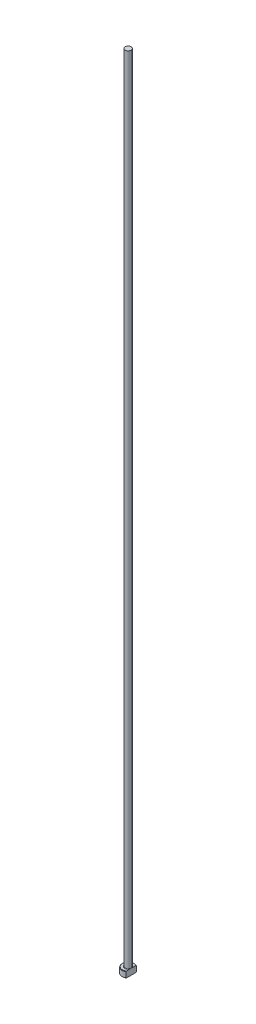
ISO-10303-21;
HEADER;
FILE_DESCRIPTION(('STEP AP214'),'2;1');
FILE_NAME('part.step','',(''),(''),'','','');
FILE_SCHEMA(('AUTOMOTIVE_DESIGN { 1 0 10303 214 1 1 1 1 }'));
ENDSEC;
DATA;
#1=APPLICATION_CONTEXT('core data for automotive mechanical design processes');
#2=APPLICATION_PROTOCOL_DEFINITION('international standard','automotive_design',2000,#1);
#3=PRODUCT_CONTEXT('',#1,'mechanical');
#4=PRODUCT('Part','Part','',(#3));
#5=PRODUCT_RELATED_PRODUCT_CATEGORY('part','',(#4));
#6=PRODUCT_DEFINITION_FORMATION('','',#4);
#7=PRODUCT_DEFINITION_CONTEXT('part definition',#1,'design');
#8=PRODUCT_DEFINITION('design','',#6,#7);
#9=PRODUCT_DEFINITION_SHAPE('','',#8);
#10=(LENGTH_UNIT() NAMED_UNIT(*) SI_UNIT(.MILLI.,.METRE.));
#11=(NAMED_UNIT(*) PLANE_ANGLE_UNIT() SI_UNIT($,.RADIAN.));
#12=(NAMED_UNIT(*) SI_UNIT($,.STERADIAN.) SOLID_ANGLE_UNIT());
#13=UNCERTAINTY_MEASURE_WITH_UNIT(LENGTH_MEASURE(1.E-05),#10,'distance_accuracy_value','');
#14=(GEOMETRIC_REPRESENTATION_CONTEXT(3) GLOBAL_UNCERTAINTY_ASSIGNED_CONTEXT((#13)) GLOBAL_UNIT_ASSIGNED_CONTEXT((#10,
#11,#12)) REPRESENTATION_CONTEXT('',''));
#15=CARTESIAN_POINT('',(0.,0.,0.));
#16=DIRECTION('',(0.,0.,1.));
#17=DIRECTION('',(1.,0.,0.));
#18=AXIS2_PLACEMENT_3D('',#15,#16,#17);
#19=CARTESIAN_POINT('',(0.,0.,0.));
#20=DIRECTION('',(0.,-1.,0.));
#21=DIRECTION('',(0.,0.,-1.));
#22=AXIS2_PLACEMENT_3D('',#19,#20,#21);
#23=PLANE('',#22);
#24=CARTESIAN_POINT('',(0.,0.,0.));
#25=DIRECTION('',(0.,-1.,0.));
#26=DIRECTION('',(0.,0.,-1.));
#27=AXIS2_PLACEMENT_3D('',#24,#25,#26);
#28=CIRCLE('',#27,2.79999999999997);
#29=CARTESIAN_POINT('',(1.49999999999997,0.,2.36431808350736));
#30=VERTEX_POINT('',#29);
#31=CARTESIAN_POINT('',(1.49999999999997,0.,-2.36431808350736));
#32=VERTEX_POINT('',#31);
#33=EDGE_CURVE('E98',#30,#32,#28,.T.);
#34=ORIENTED_EDGE('',*,*,#33,.T.);
#35=DIRECTION('',(0.,0.,1.));
#36=VECTOR('',#35,1.);
#37=CARTESIAN_POINT('',(1.49999999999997,0.,-2.5980762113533));
#38=LINE('',#37,#36);
#39=EDGE_CURVE('E83',#32,#30,#38,.T.);
#40=ORIENTED_EDGE('',*,*,#39,.T.);
#41=EDGE_LOOP('',(#34,#40));
#42=FACE_BOUND('',#41,.T.);
#43=ADVANCED_FACE('F32',(#42),#23,.T.);
#44=CARTESIAN_POINT('',(0.,259.958771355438,0.));
#45=DIRECTION('',(0.,1.,0.));
#46=DIRECTION('',(0.,0.,1.));
#47=AXIS2_PLACEMENT_3D('',#44,#45,#46);
#48=CYLINDRICAL_SURFACE('',#47,2.99999999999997);
#49=CARTESIAN_POINT('',(0.,2.80000000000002,0.));
#50=DIRECTION('',(0.,1.,0.));
#51=DIRECTION('',(0.,0.,1.));
#52=AXIS2_PLACEMENT_3D('',#49,#50,#51);
#53=CIRCLE('',#52,2.99999999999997);
#54=CARTESIAN_POINT('',(1.49999999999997,2.80000000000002,2.5980762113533));
#55=VERTEX_POINT('',#54);
#56=CARTESIAN_POINT('',(1.49999999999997,2.80000000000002,-2.5980762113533));
#57=VERTEX_POINT('',#56);
#58=EDGE_CURVE('E104',#55,#57,#53,.F.);
#59=ORIENTED_EDGE('',*,*,#58,.T.);
#60=DIRECTION('',(0.,-1.,0.));
#61=VECTOR('',#60,1.);
#62=CARTESIAN_POINT('',(1.49999999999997,400.,-2.5980762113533));
#63=LINE('',#62,#61);
#64=CARTESIAN_POINT('',(1.49999999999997,0.199999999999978,-2.5980762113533));
#65=VERTEX_POINT('',#64);
#66=EDGE_CURVE('E183',#57,#65,#63,.T.);
#67=ORIENTED_EDGE('',*,*,#66,.T.);
#68=CARTESIAN_POINT('',(0.,0.199999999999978,0.));
#69=DIRECTION('',(0.,-1.,0.));
#70=DIRECTION('',(0.,0.,-1.));
#71=AXIS2_PLACEMENT_3D('',#68,#69,#70);
#72=CIRCLE('',#71,2.99999999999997);
#73=CARTESIAN_POINT('',(1.49999999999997,0.199999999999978,2.5980762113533));
#74=VERTEX_POINT('',#73);
#75=EDGE_CURVE('E100',#65,#74,#72,.F.);
#76=ORIENTED_EDGE('',*,*,#75,.T.);
#77=DIRECTION('',(0.,-1.,0.));
#78=VECTOR('',#77,1.);
#79=CARTESIAN_POINT('',(1.49999999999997,400.,2.5980762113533));
#80=LINE('',#79,#78);
#81=EDGE_CURVE('E93',#55,#74,#80,.T.);
#82=ORIENTED_EDGE('',*,*,#81,.F.);
#83=EDGE_LOOP('',(#59,#67,#76,#82));
#84=FACE_BOUND('',#83,.T.);
#85=ADVANCED_FACE('F158',(#84),#48,.T.);
#86=CARTESIAN_POINT('',(-2.99999999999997,3.,0.));
#87=DIRECTION('',(0.,1.,0.));
#88=DIRECTION('',(0.,0.,1.));
#89=AXIS2_PLACEMENT_3D('',#86,#87,#88);
#90=PLANE('',#89);
#91=CARTESIAN_POINT('',(0.,3.,0.));
#92=DIRECTION('',(0.,1.,0.));
#93=DIRECTION('',(0.,0.,1.));
#94=AXIS2_PLACEMENT_3D('',#91,#92,#93);
#95=CIRCLE('',#94,2.80000000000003);
#96=CARTESIAN_POINT('',(1.49999999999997,3.,-2.36431808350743));
#97=VERTEX_POINT('',#96);
#98=CARTESIAN_POINT('',(1.49999999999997,3.,2.36431808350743));
#99=VERTEX_POINT('',#98);
#100=EDGE_CURVE('E178',#97,#99,#95,.T.);
#101=ORIENTED_EDGE('',*,*,#100,.T.);
#102=DIRECTION('',(0.,0.,-1.));
#103=VECTOR('',#102,1.);
#104=CARTESIAN_POINT('',(1.49999999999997,3.,0.));
#105=LINE('',#104,#103);
#106=CARTESIAN_POINT('',(1.49999999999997,2.99999999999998,0.799999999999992));
#107=VERTEX_POINT('',#106);
#108=EDGE_CURVE('E57',#99,#107,#105,.T.);
#109=ORIENTED_EDGE('',*,*,#108,.T.);
#110=CARTESIAN_POINT('',(0.,3.,0.));
#111=DIRECTION('',(0.,1.,0.));
#112=DIRECTION('',(0.,0.,1.));
#113=AXIS2_PLACEMENT_3D('',#110,#111,#112);
#114=CIRCLE('',#113,1.69999999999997);
#115=CARTESIAN_POINT('',(1.49999999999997,2.99999999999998,-0.799999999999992));
#116=VERTEX_POINT('',#115);
#117=EDGE_CURVE('E107',#107,#116,#114,.F.);
#118=ORIENTED_EDGE('',*,*,#117,.T.);
#119=EDGE_CURVE('E136',#116,#97,#105,.T.);
#120=ORIENTED_EDGE('',*,*,#119,.T.);
#121=EDGE_LOOP('',(#101,#109,#118,#120));
#122=FACE_BOUND('',#121,.T.);
#123=ADVANCED_FACE('F147',(#122),#90,.T.);
#124=CARTESIAN_POINT('',(0.,3.,0.));
#125=DIRECTION('',(0.,-1.,0.));
#126=DIRECTION('',(0.,0.,-1.));
#127=AXIS2_PLACEMENT_3D('',#124,#125,#126);
#128=CONICAL_SURFACE('',#127,2.80000000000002,0.785398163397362);
#129=ORIENTED_EDGE('',*,*,#58,.F.);
#130=CARTESIAN_POINT('',(1.49999999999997,-0.111741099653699,5.71827621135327));
#131=CARTESIAN_POINT('',(1.49999999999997,0.013618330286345,5.58866816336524));
#132=CARTESIAN_POINT('',(1.49999999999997,0.138843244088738,5.45892957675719));
#133=CARTESIAN_POINT('',(1.49999999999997,0.388944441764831,5.19911365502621));
#134=CARTESIAN_POINT('',(1.49999999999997,0.513820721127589,5.06903631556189));
#135=CARTESIAN_POINT('',(1.49999999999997,0.763205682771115,4.80840180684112));
#136=CARTESIAN_POINT('',(1.49999999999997,0.887714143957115,4.67784442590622));
#137=CARTESIAN_POINT('',(1.49999999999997,1.13618059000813,4.41620813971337));
#138=CARTESIAN_POINT('',(1.49999999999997,1.26013857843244,4.28512923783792));
#139=CARTESIAN_POINT('',(1.49999999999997,1.50488975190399,4.02490837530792));
#140=CARTESIAN_POINT('',(1.49999999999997,1.62569693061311,3.89577958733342));
#141=CARTESIAN_POINT('',(1.49999999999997,1.86640694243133,3.63668213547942));
#142=CARTESIAN_POINT('',(1.49999999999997,1.98630978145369,3.50671347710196));
#143=CARTESIAN_POINT('',(1.49999999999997,2.2248603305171,3.24567921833));
#144=CARTESIAN_POINT('',(1.49999999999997,2.34350830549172,3.11461386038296));
#145=CARTESIAN_POINT('',(1.49999999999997,2.57907716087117,2.85094268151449));
#146=CARTESIAN_POINT('',(1.49999999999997,2.69599811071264,2.71833692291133));
#147=CARTESIAN_POINT('',(1.49999999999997,2.88262371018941,2.50255231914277));
#148=CARTESIAN_POINT('',(1.49999999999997,2.95312454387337,2.42006293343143));
#149=CARTESIAN_POINT('',(1.49999999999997,3.0928709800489,2.25401084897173));
#150=CARTESIAN_POINT('',(1.49999999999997,3.16211645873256,2.17044804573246));
#151=CARTESIAN_POINT('',(1.49999999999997,3.29964684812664,2.00105967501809));
#152=CARTESIAN_POINT('',(1.49999999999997,3.36791386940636,1.91521952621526));
#153=CARTESIAN_POINT('',(1.49999999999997,3.50205840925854,1.74171392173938));
#154=CARTESIAN_POINT('',(1.49999999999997,3.56793649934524,1.65404891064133));
#155=CARTESIAN_POINT('',(1.49999999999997,3.69728151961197,1.47490236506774));
#156=CARTESIAN_POINT('',(1.49999999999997,3.76069661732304,1.3833830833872));
#157=CARTESIAN_POINT('',(1.49999999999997,3.88239539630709,1.19675661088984));
#158=CARTESIAN_POINT('',(1.49999999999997,3.94067201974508,1.10164473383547));
#159=CARTESIAN_POINT('',(1.49999999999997,4.04841325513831,0.908008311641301));
#160=CARTESIAN_POINT('',(1.49999999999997,4.09797809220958,0.809540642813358));
#161=CARTESIAN_POINT('',(1.49999999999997,4.18432188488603,0.607192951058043));
#162=CARTESIAN_POINT('',(1.49999999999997,4.22114374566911,0.50333247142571));
#163=CARTESIAN_POINT('',(1.49999999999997,4.26099935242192,0.347577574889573));
#164=CARTESIAN_POINT('',(1.49999999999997,4.27157029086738,0.297609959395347));
#165=CARTESIAN_POINT('',(1.49999999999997,4.28794860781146,0.196885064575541));
#166=CARTESIAN_POINT('',(1.49999999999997,4.29375640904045,0.1461278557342));
#167=CARTESIAN_POINT('',(1.49999999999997,4.30019707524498,0.0444388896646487));
#168=CARTESIAN_POINT('',(1.49999999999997,4.30084594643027,-0.0064918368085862));
#169=CARTESIAN_POINT('',(1.49999999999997,4.29696416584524,-0.108155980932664));
#170=CARTESIAN_POINT('',(1.49999999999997,4.29243308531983,-0.158889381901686));
#171=CARTESIAN_POINT('',(1.49999999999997,4.27856915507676,-0.259234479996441));
#172=CARTESIAN_POINT('',(1.49999999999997,4.26927821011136,-0.308852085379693));
#173=CARTESIAN_POINT('',(1.49999999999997,4.24647108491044,-0.407110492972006));
#174=CARTESIAN_POINT('',(1.49999999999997,4.23295324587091,-0.455750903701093));
#175=CARTESIAN_POINT('',(1.49999999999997,4.20226175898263,-0.552149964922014));
#176=CARTESIAN_POINT('',(1.49999999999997,4.18506801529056,-0.599902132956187));
#177=CARTESIAN_POINT('',(1.49999999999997,4.14771387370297,-0.694205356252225));
#178=CARTESIAN_POINT('',(1.49999999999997,4.12755408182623,-0.74075665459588));
#179=CARTESIAN_POINT('',(1.49999999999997,4.06327696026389,-0.879166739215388));
#180=CARTESIAN_POINT('',(1.49999999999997,4.01551721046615,-0.969329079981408));
#181=CARTESIAN_POINT('',(1.49999999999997,3.91367909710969,-1.14604316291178));
#182=CARTESIAN_POINT('',(1.49999999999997,3.85959300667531,-1.23259031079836));
#183=CARTESIAN_POINT('',(1.49999999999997,3.74697968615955,-1.40321348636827));
#184=CARTESIAN_POINT('',(1.49999999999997,3.68843573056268,-1.48727838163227));
#185=CARTESIAN_POINT('',(1.49999999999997,3.56843845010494,-1.65322187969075));
#186=CARTESIAN_POINT('',(1.49999999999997,3.50698656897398,-1.73510153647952));
#187=CARTESIAN_POINT('',(1.49999999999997,3.3811567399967,-1.89829823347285));
#188=CARTESIAN_POINT('',(1.49999999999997,3.31675092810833,-1.97959369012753));
#189=CARTESIAN_POINT('',(1.49999999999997,3.18634068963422,-2.14090082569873));
#190=CARTESIAN_POINT('',(1.49999999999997,3.12033609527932,-2.22091236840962));
#191=CARTESIAN_POINT('',(1.49999999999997,2.92086431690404,-2.4590650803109));
#192=CARTESIAN_POINT('',(1.49999999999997,2.78562663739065,-2.61572090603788));
#193=CARTESIAN_POINT('',(1.49999999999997,2.53554498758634,-2.90006295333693));
#194=CARTESIAN_POINT('',(1.49999999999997,2.42114543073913,-3.0281438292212));
#195=CARTESIAN_POINT('',(1.49999999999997,2.19093557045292,-3.28303767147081));
#196=CARTESIAN_POINT('',(1.49999999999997,2.07512522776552,-3.40985060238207));
#197=CARTESIAN_POINT('',(1.49999999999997,1.72597067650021,-3.7891384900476));
#198=CARTESIAN_POINT('',(1.49999999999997,1.49111760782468,-4.04022177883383));
#199=CARTESIAN_POINT('',(1.49999999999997,1.02882478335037,-4.52992803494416));
#200=CARTESIAN_POINT('',(1.49999999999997,0.801477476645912,-4.76863870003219));
#201=CARTESIAN_POINT('',(1.49999999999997,0.459548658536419,-5.12558036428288));
#202=CARTESIAN_POINT('',(1.49999999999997,0.345484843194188,-5.24430773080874));
#203=CARTESIAN_POINT('',(1.49999999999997,0.117071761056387,-5.48148573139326));
#204=CARTESIAN_POINT('',(1.49999999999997,0.00272249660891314,-5.59993636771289));
#205=CARTESIAN_POINT('',(1.49999999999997,-0.111741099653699,-5.71827621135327));
#206=B_SPLINE_CURVE_WITH_KNOTS('',3,(#130,#131,#132,#133,#134,#135,#136,#137,#138,#139,#140,
#141,#142,#143,#144,#145,#146,#147,#148,#149,#150,#151,#152,#153,#154,#155,#156,#157,#158,#159,
#160,#161,#162,#163,#164,#165,#166,#167,#168,#169,#170,#171,#172,#173,#174,#175,#176,#177,#178,
#179,#180,#181,#182,#183,#184,#185,#186,#187,#188,#189,#190,#191,#192,#193,#194,#195,#196,#197,
#198,#199,#200,#201,#202,#203,#204,#205),.UNSPECIFIED.,.F.,.F.,(4,2,2,2,2,2,2,2,2,2,2,2,2,2,2,2,
2,2,2,2,2,2,2,2,2,2,2,2,2,2,2,2,2,2,2,2,2,4),(0.,0.540943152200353,1.08189327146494,
1.62312052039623,2.16434426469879,2.69482920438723,3.22531067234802,3.75567781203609,
4.28602356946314,4.61155053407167,4.93710943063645,5.26610945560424,5.59503024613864,
5.92894782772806,6.26331713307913,6.59354403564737,6.92264800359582,7.07567478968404,
7.22868799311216,7.38122626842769,7.53377717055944,7.68500755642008,7.83629736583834,
7.98843643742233,8.14054446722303,8.44618799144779,8.75220879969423,9.05944044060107,
9.3665211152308,9.67764287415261,9.98879742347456,10.6095925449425,11.1247803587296,
11.6399825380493,12.6713544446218,13.6603005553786,14.1542238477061,14.6481430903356),.UNSPECIFIED.);
#207=EDGE_CURVE('E135',#55,#99,#206,.T.);
#208=ORIENTED_EDGE('',*,*,#207,.T.);
#209=ORIENTED_EDGE('',*,*,#100,.F.);
#210=EDGE_CURVE('E127',#97,#57,#206,.T.);
#211=ORIENTED_EDGE('',*,*,#210,.T.);
#212=EDGE_LOOP('',(#129,#208,#209,#211));
#213=FACE_BOUND('',#212,.T.);
#214=ADVANCED_FACE('F143',(#213),#128,.T.);
#215=CARTESIAN_POINT('',(0.,0.199999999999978,0.));
#216=DIRECTION('',(0.,1.,0.));
#217=DIRECTION('',(0.,0.,1.));
#218=AXIS2_PLACEMENT_3D('',#215,#216,#217);
#219=CONICAL_SURFACE('',#218,2.99999999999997,0.7853981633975);
#220=ORIENTED_EDGE('',*,*,#75,.F.);
#221=CARTESIAN_POINT('',(1.49999999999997,3.11174109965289,-5.71827621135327));
#222=CARTESIAN_POINT('',(1.49999999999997,2.98638166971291,-5.58866816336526));
#223=CARTESIAN_POINT('',(1.49999999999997,2.86115675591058,-5.45892957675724));
#224=CARTESIAN_POINT('',(1.49999999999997,2.6110555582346,-5.19911365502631));
#225=CARTESIAN_POINT('',(1.49999999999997,2.4861792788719,-5.06903631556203));
#226=CARTESIAN_POINT('',(1.49999999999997,2.2367943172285,-4.8084018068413));
#227=CARTESIAN_POINT('',(1.49999999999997,2.11228585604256,-4.67784442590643));
#228=CARTESIAN_POINT('',(1.49999999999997,1.86381940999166,-4.41620813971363));
#229=CARTESIAN_POINT('',(1.49999999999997,1.73986142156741,-4.28512923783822));
#230=CARTESIAN_POINT('',(1.49999999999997,1.49511024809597,-4.02490837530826));
#231=CARTESIAN_POINT('',(1.49999999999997,1.37430306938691,-3.89577958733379));
#232=CARTESIAN_POINT('',(1.49999999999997,1.1335930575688,-3.63668213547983));
#233=CARTESIAN_POINT('',(1.49999999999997,1.01369021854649,-3.5067134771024));
#234=CARTESIAN_POINT('',(1.49999999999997,0.775139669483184,-3.24567921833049));
#235=CARTESIAN_POINT('',(1.49999999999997,0.656491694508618,-3.11461386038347));
#236=CARTESIAN_POINT('',(1.49999999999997,0.420922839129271,-2.85094268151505));
#237=CARTESIAN_POINT('',(1.49999999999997,0.304001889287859,-2.71833692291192));
#238=CARTESIAN_POINT('',(1.49999999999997,0.117376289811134,-2.50255231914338));
#239=CARTESIAN_POINT('',(1.49999999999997,0.0468754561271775,-2.42006293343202));
#240=CARTESIAN_POINT('',(1.49999999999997,-0.0928709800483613,-2.25401084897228));
#241=CARTESIAN_POINT('',(1.49999999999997,-0.16211645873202,-2.170448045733));
#242=CARTESIAN_POINT('',(1.49999999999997,-0.299646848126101,-2.00105967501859));
#243=CARTESIAN_POINT('',(1.49999999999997,-0.36791386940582,-1.91521952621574));
#244=CARTESIAN_POINT('',(1.49999999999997,-0.502058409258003,-1.74171392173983));
#245=CARTESIAN_POINT('',(1.49999999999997,-0.567936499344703,-1.65404891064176));
#246=CARTESIAN_POINT('',(1.49999999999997,-0.697281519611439,-1.47490236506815));
#247=CARTESIAN_POINT('',(1.49999999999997,-0.760696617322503,-1.38338308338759));
#248=CARTESIAN_POINT('',(1.49999999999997,-0.88239539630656,-1.1967566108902));
#249=CARTESIAN_POINT('',(1.49999999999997,-0.940672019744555,-1.10164473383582));
#250=CARTESIAN_POINT('',(1.49999999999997,-1.04841325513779,-0.908008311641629));
#251=CARTESIAN_POINT('',(1.49999999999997,-1.09797809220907,-0.809540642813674));
#252=CARTESIAN_POINT('',(1.49999999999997,-1.18432188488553,-0.607192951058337));
#253=CARTESIAN_POINT('',(1.49999999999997,-1.22114374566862,-0.503332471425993));
#254=CARTESIAN_POINT('',(1.49999999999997,-1.26099935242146,-0.347577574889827));
#255=CARTESIAN_POINT('',(1.49999999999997,-1.27157029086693,-0.297609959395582));
#256=CARTESIAN_POINT('',(1.49999999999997,-1.28794860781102,-0.19688506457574));
#257=CARTESIAN_POINT('',(1.49999999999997,-1.29375640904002,-0.146127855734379));
#258=CARTESIAN_POINT('',(1.49999999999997,-1.30019707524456,-0.0444388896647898));
#259=CARTESIAN_POINT('',(1.49999999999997,-1.30084594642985,0.00649183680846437));
#260=CARTESIAN_POINT('',(1.49999999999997,-1.29696416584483,0.108155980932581));
#261=CARTESIAN_POINT('',(1.49999999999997,-1.29243308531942,0.158889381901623));
#262=CARTESIAN_POINT('',(1.49999999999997,-1.27856915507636,0.259234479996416));
#263=CARTESIAN_POINT('',(1.49999999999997,-1.26927821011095,0.308852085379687));
#264=CARTESIAN_POINT('',(1.49999999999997,-1.24647108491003,0.407110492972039));
#265=CARTESIAN_POINT('',(1.49999999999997,-1.2329532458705,0.455750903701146));
#266=CARTESIAN_POINT('',(1.49999999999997,-1.20226175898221,0.552149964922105));
#267=CARTESIAN_POINT('',(1.49999999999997,-1.18506801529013,0.599902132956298));
#268=CARTESIAN_POINT('',(1.49999999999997,-1.14771387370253,0.694205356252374));
#269=CARTESIAN_POINT('',(1.49999999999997,-1.12755408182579,0.740756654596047));
#270=CARTESIAN_POINT('',(1.49999999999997,-1.06327696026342,0.879166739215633));
#271=CARTESIAN_POINT('',(1.49999999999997,-1.01551721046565,0.969329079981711));
#272=CARTESIAN_POINT('',(1.49999999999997,-0.913679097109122,1.1460431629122));
#273=CARTESIAN_POINT('',(1.49999999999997,-0.859593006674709,1.23259031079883));
#274=CARTESIAN_POINT('',(1.49999999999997,-0.746979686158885,1.40321348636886));
#275=CARTESIAN_POINT('',(1.49999999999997,-0.688435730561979,1.48727838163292));
#276=CARTESIAN_POINT('',(1.49999999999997,-0.568438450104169,1.6532218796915));
#277=CARTESIAN_POINT('',(1.49999999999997,-0.506986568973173,1.73510153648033));
#278=CARTESIAN_POINT('',(1.49999999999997,-0.381156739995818,1.89829823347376));
#279=CARTESIAN_POINT('',(1.49999999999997,-0.316750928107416,1.9795936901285));
#280=CARTESIAN_POINT('',(1.49999999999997,-0.186340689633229,2.14090082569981));
#281=CARTESIAN_POINT('',(1.49999999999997,-0.120336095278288,2.22091236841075));
#282=CARTESIAN_POINT('',(1.49999999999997,0.0791356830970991,2.45906508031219));
#283=CARTESIAN_POINT('',(1.49999999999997,0.21437336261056,2.61572090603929));
#284=CARTESIAN_POINT('',(1.49999999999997,0.464455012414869,2.90006295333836));
#285=CARTESIAN_POINT('',(1.49999999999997,0.578854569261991,3.02814382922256));
#286=CARTESIAN_POINT('',(1.49999999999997,0.809064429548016,3.28303767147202));
#287=CARTESIAN_POINT('',(1.49999999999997,0.924874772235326,3.40985060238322));
#288=CARTESIAN_POINT('',(1.49999999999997,1.27402932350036,3.78913849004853));
#289=CARTESIAN_POINT('',(1.49999999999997,1.50888239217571,4.04022177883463));
#290=CARTESIAN_POINT('',(1.49999999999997,1.97117521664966,4.52992803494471));
#291=CARTESIAN_POINT('',(1.49999999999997,2.19852252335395,4.76863870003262));
#292=CARTESIAN_POINT('',(1.49999999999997,2.54045134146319,5.12558036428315));
#293=CARTESIAN_POINT('',(1.49999999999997,2.65451515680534,5.24430773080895));
#294=CARTESIAN_POINT('',(1.49999999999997,2.88292823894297,5.48148573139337));
#295=CARTESIAN_POINT('',(1.49999999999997,2.99727750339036,5.59993636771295));
#296=CARTESIAN_POINT('',(1.49999999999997,3.11174109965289,5.71827621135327));
#297=B_SPLINE_CURVE_WITH_KNOTS('',3,(#221,#222,#223,#224,#225,#226,#227,#228,#229,#230,#231,
#232,#233,#234,#235,#236,#237,#238,#239,#240,#241,#242,#243,#244,#245,#246,#247,#248,#249,#250,
#251,#252,#253,#254,#255,#256,#257,#258,#259,#260,#261,#262,#263,#264,#265,#266,#267,#268,#269,
#270,#271,#272,#273,#274,#275,#276,#277,#278,#279,#280,#281,#282,#283,#284,#285,#286,#287,#288,
#289,#290,#291,#292,#293,#294,#295,#296),.UNSPECIFIED.,.F.,.F.,(4,2,2,2,2,2,2,2,2,2,2,2,2,2,2,2,
2,2,2,2,2,2,2,2,2,2,2,2,2,2,2,2,2,2,2,2,2,4),(0.,0.540943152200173,1.08189327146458,
1.62312052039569,2.16434426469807,2.69482920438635,3.22531067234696,3.75567781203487,
4.28602356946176,4.61155053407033,4.93710943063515,5.26610945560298,5.59503024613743,
5.92894782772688,6.26331713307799,6.59354403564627,6.92264800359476,7.07567478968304,
7.22868799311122,7.38122626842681,7.53377717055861,7.68500755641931,7.83629736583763,
7.98843643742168,8.14054446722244,8.44618799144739,8.75220879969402,9.05944044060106,
9.36652111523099,9.67764287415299,9.98879742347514,10.6095925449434,11.1247803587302,
11.6399825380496,12.6713544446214,13.6603005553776,14.1542238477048,14.648143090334),.UNSPECIFIED.);
#298=EDGE_CURVE('E86',#65,#32,#297,.T.);
#299=ORIENTED_EDGE('',*,*,#298,.T.);
#300=ORIENTED_EDGE('',*,*,#33,.F.);
#301=EDGE_CURVE('E89',#30,#74,#297,.T.);
#302=ORIENTED_EDGE('',*,*,#301,.T.);
#303=EDGE_LOOP('',(#220,#299,#300,#302));
#304=FACE_BOUND('',#303,.T.);
#305=ADVANCED_FACE('F97',(#304),#219,.T.);
#306=CARTESIAN_POINT('',(0.,3.19999999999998,0.));
#307=DIRECTION('',(0.,1.,0.));
#308=DIRECTION('',(0.,0.,1.));
#309=AXIS2_PLACEMENT_3D('',#306,#307,#308);
#310=TOROIDAL_SURFACE('',#309,1.69999999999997,0.2);
#311=CARTESIAN_POINT('',(1.49999999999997,3.19999999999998,0.));
#312=CARTESIAN_POINT('',(1.49999999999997,3.20000050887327,7.14686524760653E-11));
#313=CARTESIAN_POINT('',(1.49999999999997,3.20000101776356,-1.21663671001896E-07));
#314=CARTESIAN_POINT('',(1.49999999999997,3.20000199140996,-4.97616231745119E-07));
#315=CARTESIAN_POINT('',(1.49999999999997,3.20000245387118,-7.56516213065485E-07));
#316=CARTESIAN_POINT('',(1.49999999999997,3.20000338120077,-1.37642836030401E-06));
#317=CARTESIAN_POINT('',(1.49999999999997,3.20000384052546,-1.74563475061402E-06));
#318=CARTESIAN_POINT('',(1.49999999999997,3.20000469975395,-2.53565983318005E-06));
#319=CARTESIAN_POINT('',(1.49999999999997,3.20000510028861,-2.95582595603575E-06));
#320=CARTESIAN_POINT('',(1.49999999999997,3.20000646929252,-4.48430443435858E-06));
#321=CARTESIAN_POINT('',(1.49999999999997,3.20000736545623,-5.6586103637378E-06));
#322=CARTESIAN_POINT('',(1.49999999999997,3.20000893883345,-8.06479198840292E-06));
#323=CARTESIAN_POINT('',(1.49999999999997,3.20000962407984,-9.29170513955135E-06));
#324=CARTESIAN_POINT('',(1.49999999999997,3.2000122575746,-1.41623288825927E-05));
#325=CARTESIAN_POINT('',(1.49999999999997,3.20001407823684,-1.78790031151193E-05));
#326=CARTESIAN_POINT('',(1.49999999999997,3.20001699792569,-2.51443065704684E-05));
#327=CARTESIAN_POINT('',(1.49999999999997,3.20001815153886,-2.86715393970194E-05));
#328=CARTESIAN_POINT('',(1.49999999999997,3.20002315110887,-4.39218127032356E-05));
#329=CARTESIAN_POINT('',(1.49999999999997,3.2000270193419,-5.56288388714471E-05));
#330=CARTESIAN_POINT('',(1.49999999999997,3.20003312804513,-7.74058287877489E-05));
#331=CARTESIAN_POINT('',(1.49999999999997,3.20003553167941,-8.7427840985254E-05));
#332=CARTESIAN_POINT('',(1.49999999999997,3.20005483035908,-0.00016122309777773));
#333=CARTESIAN_POINT('',(1.49999999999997,3.2000797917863,-0.000222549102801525));
#334=CARTESIAN_POINT('',(1.49999999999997,3.20017391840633,-0.000462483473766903));
#335=CARTESIAN_POINT('',(1.49999999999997,3.20023706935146,-0.000642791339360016));
#336=CARTESIAN_POINT('',(1.49999999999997,3.20048761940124,-0.00134785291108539));
#337=CARTESIAN_POINT('',(1.49999999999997,3.20068132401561,-0.00187087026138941));
#338=CARTESIAN_POINT('',(1.49999999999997,3.20147357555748,-0.0040200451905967));
#339=CARTESIAN_POINT('',(1.49999999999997,3.20206499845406,-0.00564811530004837));
#340=CARTESIAN_POINT('',(1.49999999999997,3.2089263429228,-0.0245232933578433));
#341=CARTESIAN_POINT('',(1.49999999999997,3.21523683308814,-0.0417598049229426));
#342=CARTESIAN_POINT('',(1.49999999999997,3.22755028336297,-0.0756091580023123));
#343=CARTESIAN_POINT('',(1.49999999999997,3.23355589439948,-0.0922211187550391));
#344=CARTESIAN_POINT('',(1.49999999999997,3.2462010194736,-0.127454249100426));
#345=CARTESIAN_POINT('',(1.49999999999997,3.25283080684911,-0.146078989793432));
#346=CARTESIAN_POINT('',(1.49999999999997,3.26599765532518,-0.183577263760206));
#347=CARTESIAN_POINT('',(1.49999999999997,3.2725330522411,-0.202451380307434));
#348=CARTESIAN_POINT('',(1.49999999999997,3.28834228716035,-0.248982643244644));
#349=CARTESIAN_POINT('',(1.49999999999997,3.29749152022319,-0.276682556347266));
#350=CARTESIAN_POINT('',(1.49999999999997,3.3149093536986,-0.331625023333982));
#351=CARTESIAN_POINT('',(1.49999999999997,3.32319386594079,-0.358862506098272));
#352=CARTESIAN_POINT('',(1.49999999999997,3.34051594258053,-0.419125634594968));
#353=CARTESIAN_POINT('',(1.49999999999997,3.34936607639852,-0.452206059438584));
#354=CARTESIAN_POINT('',(1.49999999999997,3.36549583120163,-0.519023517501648));
#355=CARTESIAN_POINT('',(1.49999999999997,3.37276283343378,-0.552763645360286));
#356=CARTESIAN_POINT('',(1.49999999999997,3.38554755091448,-0.623053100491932));
#357=CARTESIAN_POINT('',(1.49999999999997,3.39090573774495,-0.659632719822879));
#358=CARTESIAN_POINT('',(1.49999999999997,3.39825016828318,-0.733028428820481));
#359=CARTESIAN_POINT('',(1.49999999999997,3.40024734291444,-0.769843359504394));
#360=CARTESIAN_POINT('',(1.49999999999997,3.39970780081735,-0.842856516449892));
#361=CARTESIAN_POINT('',(1.49999999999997,3.39725347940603,-0.87905368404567));
#362=CARTESIAN_POINT('',(1.49999999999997,3.38900085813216,-0.932380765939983));
#363=CARTESIAN_POINT('',(1.49999999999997,3.38553049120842,-0.949868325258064));
#364=CARTESIAN_POINT('',(1.49999999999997,3.37678336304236,-0.98437493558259));
#365=CARTESIAN_POINT('',(1.49999999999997,3.37150943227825,-1.00139467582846));
#366=CARTESIAN_POINT('',(1.49999999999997,3.35869781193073,-1.03479423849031));
#367=CARTESIAN_POINT('',(1.49999999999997,3.3511359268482,-1.05116499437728));
#368=CARTESIAN_POINT('',(1.49999999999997,3.33325333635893,-1.08234828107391));
#369=CARTESIAN_POINT('',(1.49999999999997,3.32294266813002,-1.097166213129));
#370=CARTESIAN_POINT('',(1.49999999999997,3.30512758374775,-1.11714173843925));
#371=CARTESIAN_POINT('',(1.49999999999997,3.29884721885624,-1.1233906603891));
#372=CARTESIAN_POINT('',(1.49999999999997,3.28545950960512,-1.13494695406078));
#373=CARTESIAN_POINT('',(1.49999999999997,3.27835226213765,-1.14025443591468));
#374=CARTESIAN_POINT('',(1.49999999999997,3.26325970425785,-1.14967631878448));
#375=CARTESIAN_POINT('',(1.49999999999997,3.25526534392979,-1.1537764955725));
#376=CARTESIAN_POINT('',(1.49999999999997,3.23863207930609,-1.16034952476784));
#377=CARTESIAN_POINT('',(1.49999999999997,3.22999427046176,-1.16282507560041));
#378=CARTESIAN_POINT('',(1.49999999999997,3.21343922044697,-1.16570267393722));
#379=CARTESIAN_POINT('',(1.49999999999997,3.20555896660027,-1.16631687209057));
#380=CARTESIAN_POINT('',(1.49999999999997,3.18982775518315,-1.16602054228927));
#381=CARTESIAN_POINT('',(1.49999999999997,3.18197679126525,-1.16511036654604));
#382=CARTESIAN_POINT('',(1.49999999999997,3.16747846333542,-1.16204446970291));
#383=CARTESIAN_POINT('',(1.49999999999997,3.16079696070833,-1.16004509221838));
#384=CARTESIAN_POINT('',(1.49999999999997,3.14781700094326,-1.15505972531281));
#385=CARTESIAN_POINT('',(1.49999999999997,3.14151862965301,-1.1520735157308));
#386=CARTESIAN_POINT('',(1.49999999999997,3.12690214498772,-1.14387585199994));
#387=CARTESIAN_POINT('',(1.49999999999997,3.11881436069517,-1.13825400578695));
#388=CARTESIAN_POINT('',(1.49999999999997,3.1036444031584,-1.12578441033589));
#389=CARTESIAN_POINT('',(1.49999999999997,3.09656475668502,-1.11893367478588));
#390=CARTESIAN_POINT('',(1.49999999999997,3.08012297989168,-1.10074342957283));
#391=CARTESIAN_POINT('',(1.49999999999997,3.07136543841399,-1.08886044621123));
#392=CARTESIAN_POINT('',(1.49999999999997,3.05578194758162,-1.06392743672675));
#393=CARTESIAN_POINT('',(1.49999999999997,3.0489571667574,-1.05087671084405));
#394=CARTESIAN_POINT('',(1.49999999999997,3.03273856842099,-1.0147230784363));
#395=CARTESIAN_POINT('',(1.49999999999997,3.02486230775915,-0.990945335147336));
#396=CARTESIAN_POINT('',(1.49999999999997,3.01257693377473,-0.942321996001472));
#397=CARTESIAN_POINT('',(1.49999999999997,3.00820590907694,-0.917467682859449));
#398=CARTESIAN_POINT('',(1.49999999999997,3.00229956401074,-0.867912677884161));
#399=CARTESIAN_POINT('',(1.49999999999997,3.0007128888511,-0.843217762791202));
#400=CARTESIAN_POINT('',(1.49999999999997,2.9996723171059,-0.793746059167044));
#401=CARTESIAN_POINT('',(1.49999999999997,3.0002230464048,-0.768969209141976));
#402=CARTESIAN_POINT('',(1.49999999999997,3.00433101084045,-0.696994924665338));
#403=CARTESIAN_POINT('',(1.49999999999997,3.01016976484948,-0.649931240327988));
#404=CARTESIAN_POINT('',(1.49999999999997,3.02567776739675,-0.559166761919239));
#405=CARTESIAN_POINT('',(1.49999999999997,3.03511950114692,-0.515423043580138));
#406=CARTESIAN_POINT('',(1.49999999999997,3.05693059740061,-0.427590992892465));
#407=CARTESIAN_POINT('',(1.49999999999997,3.0693635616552,-0.383518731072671));
#408=CARTESIAN_POINT('',(1.49999999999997,3.0917495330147,-0.310161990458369));
#409=CARTESIAN_POINT('',(1.49999999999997,3.1011984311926,-0.280718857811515));
#410=CARTESIAN_POINT('',(1.49999999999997,3.12060442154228,-0.22234098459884));
#411=CARTESIAN_POINT('',(1.49999999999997,3.13055519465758,-0.193404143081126));
#412=CARTESIAN_POINT('',(1.49999999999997,3.14973721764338,-0.1387568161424));
#413=CARTESIAN_POINT('',(1.49999999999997,3.15893123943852,-0.113033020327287));
#414=CARTESIAN_POINT('',(1.49999999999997,3.17788037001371,-0.0606351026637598));
#415=CARTESIAN_POINT('',(1.49999999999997,3.18764328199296,-0.0339636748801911));
#416=CARTESIAN_POINT('',(1.49999999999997,3.19793548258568,-0.00564657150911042));
#417=CARTESIAN_POINT('',(1.49999999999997,3.19852751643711,-0.00401699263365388));
#418=CARTESIAN_POINT('',(1.49999999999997,3.1993199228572,-0.00186745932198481));
#419=CARTESIAN_POINT('',(1.49999999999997,3.1995131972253,-0.00134559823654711));
#420=CARTESIAN_POINT('',(1.49999999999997,3.19976322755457,-0.000641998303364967));
#421=CARTESIAN_POINT('',(1.49999999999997,3.19982627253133,-0.000461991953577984));
#422=CARTESIAN_POINT('',(1.49999999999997,3.19992025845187,-0.000222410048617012));
#423=CARTESIAN_POINT('',(1.49999999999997,3.19994519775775,-0.000161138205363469));
#424=CARTESIAN_POINT('',(1.49999999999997,3.1999644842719,-8.74039265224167E-05));
#425=CARTESIAN_POINT('',(1.49999999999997,3.19996688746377,-7.73857554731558E-05));
#426=CARTESIAN_POINT('',(1.49999999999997,3.19997299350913,-5.56173270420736E-05));
#427=CARTESIAN_POINT('',(1.49999999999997,3.19997685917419,-4.39149185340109E-05));
#428=CARTESIAN_POINT('',(1.49999999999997,3.19998185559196,-2.86698156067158E-05));
#429=CARTESIAN_POINT('',(1.49999999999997,3.19998300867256,-2.51431574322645E-05));
#430=CARTESIAN_POINT('',(1.49999999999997,3.19998592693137,-1.78789551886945E-05));
#431=CARTESIAN_POINT('',(1.49999999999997,3.19998774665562,-1.41627846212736E-05));
#432=CARTESIAN_POINT('',(1.49999999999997,3.1999903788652,-9.29264485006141E-06));
#433=CARTESIAN_POINT('',(1.49999999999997,3.19999106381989,-8.06577596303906E-06));
#434=CARTESIAN_POINT('',(1.49999999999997,3.19999263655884,-5.65962636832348E-06));
#435=CARTESIAN_POINT('',(1.49999999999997,3.19999353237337,-4.48530463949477E-06));
#436=CARTESIAN_POINT('',(1.49999999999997,3.19999490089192,-2.95673739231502E-06));
#437=CARTESIAN_POINT('',(1.49999999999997,3.19999530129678,-2.53653206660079E-06));
#438=CARTESIAN_POINT('',(1.49999999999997,3.19999616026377,-1.74640524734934E-06));
#439=CARTESIAN_POINT('',(1.49999999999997,3.19999661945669,-1.37713597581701E-06));
#440=CARTESIAN_POINT('',(1.49999999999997,3.19999754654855,-7.57072329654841E-07));
#441=CARTESIAN_POINT('',(1.49999999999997,3.1999980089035,-4.98087382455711E-07));
#442=CARTESIAN_POINT('',(1.49999999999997,3.19999898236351,-1.21927247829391E-07));
#443=CARTESIAN_POINT('',(1.49999999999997,3.19999949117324,-7.14621145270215E-11));
#444=CARTESIAN_POINT('',(1.49999999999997,3.19999999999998,0.));
#445=B_SPLINE_CURVE_WITH_KNOTS('',3,(#311,#312,#313,#314,#315,#316,#317,#318,#319,#320,#321,
#322,#323,#324,#325,#326,#327,#328,#329,#330,#331,#332,#333,#334,#335,#336,#337,#338,#339,#340,
#341,#342,#343,#344,#345,#346,#347,#348,#349,#350,#351,#352,#353,#354,#355,#356,#357,#358,#359,
#360,#361,#362,#363,#364,#365,#366,#367,#368,#369,#370,#371,#372,#373,#374,#375,#376,#377,#378,
#379,#380,#381,#382,#383,#384,#385,#386,#387,#388,#389,#390,#391,#392,#393,#394,#395,#396,#397,
#398,#399,#400,#401,#402,#403,#404,#405,#406,#407,#408,#409,#410,#411,#412,#413,#414,#415,#416,
#417,#418,#419,#420,#421,#422,#423,#424,#425,#426,#427,#428,#429,#430,#431,#432,#433,#434,#435,
#436,#437,#438,#439,#440,#441,#442,#443,#444),.UNSPECIFIED.,.T.,.F.,(4,2,2,2,2,2,2,2,2,2,2,2,2,
2,2,2,2,2,2,2,2,2,2,2,2,2,2,2,2,2,2,2,2,2,2,2,2,2,2,2,2,2,2,2,2,2,2,2,2,2,2,2,2,2,2,2,2,2,2,2,2,
2,2,2,2,2,4),(0.,1.5268750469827E-06,3.1095939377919E-06,4.8697676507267E-06,
6.6094009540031E-06,1.1020252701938E-05,1.52327800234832E-05,2.76140373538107E-05,
3.87351647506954E-05,7.57188333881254E-05,0.000106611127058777,0.000304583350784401,
0.000878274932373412,0.00255078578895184,0.00774802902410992,0.0628090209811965,
0.115802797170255,0.175110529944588,0.235030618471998,0.322539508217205,0.407938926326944,
0.510638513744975,0.614128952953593,0.724918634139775,0.835347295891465,0.943752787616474,
0.997165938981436,1.05049564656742,1.10441029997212,1.1581307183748,1.18463966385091,
1.21114550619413,1.23795217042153,1.26471419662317,1.28828324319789,1.31184684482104,
1.33268332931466,1.35352446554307,1.38290826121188,1.41236445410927,1.45639976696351,
1.5004616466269,1.5751878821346,1.65071550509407,1.72483484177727,1.79911468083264,
1.94105061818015,2.07520625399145,2.21251544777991,2.30527614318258,2.3970705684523,
2.47902409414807,2.56422207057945,2.56942417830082,2.57109299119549,2.57166572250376,
2.57186352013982,2.57189440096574,2.57193136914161,2.5719424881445,2.5719548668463,
2.57195907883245,2.5719634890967,2.571965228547,2.57196698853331,2.5719685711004,
2.57197009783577),.UNSPECIFIED.);
#446=CARTESIAN_POINT('',(1.49999999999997,3.19999999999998,0.));
#447=VERTEX_POINT('',#446);
#448=EDGE_CURVE('E11',#116,#447,#445,.T.);
#449=ORIENTED_EDGE('',*,*,#448,.F.);
#450=ORIENTED_EDGE('',*,*,#117,.F.);
#451=CARTESIAN_POINT('',(1.49999999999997,3.19999999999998,0.));
#452=CARTESIAN_POINT('',(1.49999999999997,3.19999949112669,-7.14686931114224E-11));
#453=CARTESIAN_POINT('',(1.49999999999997,3.1999989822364,1.21663670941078E-07));
#454=CARTESIAN_POINT('',(1.49999999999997,3.19999800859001,4.97616231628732E-07));
#455=CARTESIAN_POINT('',(1.49999999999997,3.19999754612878,7.56516212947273E-07));
#456=CARTESIAN_POINT('',(1.49999999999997,3.19999661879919,1.37642836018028E-06));
#457=CARTESIAN_POINT('',(1.49999999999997,3.1999961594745,1.74563475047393E-06));
#458=CARTESIAN_POINT('',(1.49999999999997,3.19999530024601,2.53565983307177E-06));
#459=CARTESIAN_POINT('',(1.49999999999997,3.19999489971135,2.95582595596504E-06));
#460=CARTESIAN_POINT('',(1.49999999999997,3.19999353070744,4.48430443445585E-06));
#461=CARTESIAN_POINT('',(1.49999999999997,3.19999263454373,5.65861036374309E-06));
#462=CARTESIAN_POINT('',(1.49999999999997,3.19999106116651,8.06479198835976E-06));
#463=CARTESIAN_POINT('',(1.49999999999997,3.19999037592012,9.29170513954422E-06));
#464=CARTESIAN_POINT('',(1.49999999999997,3.19998774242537,1.41623288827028E-05));
#465=CARTESIAN_POINT('',(1.49999999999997,3.19998592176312,1.78790031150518E-05));
#466=CARTESIAN_POINT('',(1.49999999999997,3.19998300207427,2.51443065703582E-05));
#467=CARTESIAN_POINT('',(1.49999999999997,3.1999818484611,2.86715393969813E-05));
#468=CARTESIAN_POINT('',(1.49999999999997,3.19997684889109,4.39218127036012E-05));
#469=CARTESIAN_POINT('',(1.49999999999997,3.19997298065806,5.56288388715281E-05));
#470=CARTESIAN_POINT('',(1.49999999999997,3.19996687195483,7.7405828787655E-05));
#471=CARTESIAN_POINT('',(1.49999999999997,3.19996446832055,8.74278409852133E-05));
#472=CARTESIAN_POINT('',(1.49999999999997,3.19994516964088,0.000161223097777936));
#473=CARTESIAN_POINT('',(1.49999999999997,3.19992020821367,0.00022254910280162));
#474=CARTESIAN_POINT('',(1.49999999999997,3.19982608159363,0.000462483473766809));
#475=CARTESIAN_POINT('',(1.49999999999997,3.1997629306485,0.000642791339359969));
#476=CARTESIAN_POINT('',(1.49999999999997,3.19951238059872,0.00134785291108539));
#477=CARTESIAN_POINT('',(1.49999999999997,3.19931867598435,0.00187087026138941));
#478=CARTESIAN_POINT('',(1.49999999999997,3.19852642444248,0.0040200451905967));
#479=CARTESIAN_POINT('',(1.49999999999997,3.19793500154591,0.00564811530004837));
#480=CARTESIAN_POINT('',(1.49999999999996,3.19107365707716,0.0245232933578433));
#481=CARTESIAN_POINT('',(1.49999999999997,3.18476316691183,0.0417598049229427));
#482=CARTESIAN_POINT('',(1.49999999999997,3.17244971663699,0.0756091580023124));
#483=CARTESIAN_POINT('',(1.49999999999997,3.16644410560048,0.0922211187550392));
#484=CARTESIAN_POINT('',(1.49999999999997,3.15379898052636,0.127454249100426));
#485=CARTESIAN_POINT('',(1.49999999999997,3.14716919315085,0.146078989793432));
#486=CARTESIAN_POINT('',(1.49999999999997,3.13400234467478,0.183577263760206));
#487=CARTESIAN_POINT('',(1.49999999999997,3.12746694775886,0.202451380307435));
#488=CARTESIAN_POINT('',(1.49999999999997,3.11165771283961,0.248982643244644));
#489=CARTESIAN_POINT('',(1.49999999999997,3.10250847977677,0.276682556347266));
#490=CARTESIAN_POINT('',(1.49999999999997,3.08509064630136,0.331625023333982));
#491=CARTESIAN_POINT('',(1.49999999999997,3.07680613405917,0.358862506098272));
#492=CARTESIAN_POINT('',(1.49999999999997,3.05948405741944,0.419125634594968));
#493=CARTESIAN_POINT('',(1.49999999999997,3.05063392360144,0.452206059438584));
#494=CARTESIAN_POINT('',(1.49999999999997,3.03450416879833,0.519023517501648));
#495=CARTESIAN_POINT('',(1.49999999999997,3.02723716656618,0.552763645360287));
#496=CARTESIAN_POINT('',(1.49999999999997,3.01445244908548,0.623053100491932));
#497=CARTESIAN_POINT('',(1.49999999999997,3.00909426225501,0.659632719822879));
#498=CARTESIAN_POINT('',(1.49999999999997,3.00174983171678,0.733028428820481));
#499=CARTESIAN_POINT('',(1.49999999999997,2.99975265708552,0.769843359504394));
#500=CARTESIAN_POINT('',(1.49999999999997,3.00029219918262,0.842856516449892));
#501=CARTESIAN_POINT('',(1.49999999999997,3.00274652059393,0.87905368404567));
#502=CARTESIAN_POINT('',(1.49999999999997,3.0109991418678,0.932380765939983));
#503=CARTESIAN_POINT('',(1.49999999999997,3.01446950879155,0.949868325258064));
#504=CARTESIAN_POINT('',(1.49999999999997,3.02321663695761,0.98437493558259));
#505=CARTESIAN_POINT('',(1.49999999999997,3.02849056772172,1.00139467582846));
#506=CARTESIAN_POINT('',(1.49999999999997,3.04130218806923,1.03479423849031));
#507=CARTESIAN_POINT('',(1.49999999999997,3.04886407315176,1.05116499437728));
#508=CARTESIAN_POINT('',(1.49999999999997,3.06674666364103,1.08234828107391));
#509=CARTESIAN_POINT('',(1.49999999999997,3.07705733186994,1.097166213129));
#510=CARTESIAN_POINT('',(1.49999999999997,3.09487241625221,1.11714173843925));
#511=CARTESIAN_POINT('',(1.49999999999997,3.10115278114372,1.1233906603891));
#512=CARTESIAN_POINT('',(1.49999999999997,3.11454049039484,1.13494695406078));
#513=CARTESIAN_POINT('',(1.49999999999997,3.12164773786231,1.14025443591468));
#514=CARTESIAN_POINT('',(1.49999999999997,3.13674029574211,1.14967631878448));
#515=CARTESIAN_POINT('',(1.49999999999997,3.14473465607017,1.1537764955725));
#516=CARTESIAN_POINT('',(1.49999999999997,3.16136792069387,1.16034952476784));
#517=CARTESIAN_POINT('',(1.49999999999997,3.1700057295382,1.16282507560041));
#518=CARTESIAN_POINT('',(1.49999999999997,3.18656077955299,1.16570267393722));
#519=CARTESIAN_POINT('',(1.49999999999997,3.19444103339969,1.16631687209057));
#520=CARTESIAN_POINT('',(1.49999999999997,3.21017224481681,1.16602054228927));
#521=CARTESIAN_POINT('',(1.49999999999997,3.21802320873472,1.16511036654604));
#522=CARTESIAN_POINT('',(1.49999999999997,3.23252153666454,1.16204446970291));
#523=CARTESIAN_POINT('',(1.49999999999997,3.23920303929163,1.16004509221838));
#524=CARTESIAN_POINT('',(1.49999999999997,3.2521829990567,1.15505972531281));
#525=CARTESIAN_POINT('',(1.49999999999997,3.25848137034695,1.1520735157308));
#526=CARTESIAN_POINT('',(1.49999999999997,3.27309785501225,1.14387585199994));
#527=CARTESIAN_POINT('',(1.49999999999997,3.28118563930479,1.13825400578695));
#528=CARTESIAN_POINT('',(1.49999999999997,3.29635559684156,1.12578441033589));
#529=CARTESIAN_POINT('',(1.49999999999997,3.30343524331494,1.11893367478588));
#530=CARTESIAN_POINT('',(1.49999999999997,3.31987702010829,1.10074342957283));
#531=CARTESIAN_POINT('',(1.49999999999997,3.32863456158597,1.08886044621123));
#532=CARTESIAN_POINT('',(1.49999999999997,3.34421805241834,1.06392743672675));
#533=CARTESIAN_POINT('',(1.49999999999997,3.35104283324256,1.05087671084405));
#534=CARTESIAN_POINT('',(1.49999999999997,3.36726143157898,1.0147230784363));
#535=CARTESIAN_POINT('',(1.49999999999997,3.37513769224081,0.990945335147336));
#536=CARTESIAN_POINT('',(1.49999999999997,3.38742306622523,0.942321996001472));
#537=CARTESIAN_POINT('',(1.49999999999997,3.39179409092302,0.917467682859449));
#538=CARTESIAN_POINT('',(1.49999999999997,3.39770043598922,0.867912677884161));
#539=CARTESIAN_POINT('',(1.49999999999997,3.39928711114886,0.843217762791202));
#540=CARTESIAN_POINT('',(1.49999999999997,3.40032768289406,0.793746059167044));
#541=CARTESIAN_POINT('',(1.49999999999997,3.39977695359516,0.768969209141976));
#542=CARTESIAN_POINT('',(1.49999999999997,3.39566898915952,0.696994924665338));
#543=CARTESIAN_POINT('',(1.49999999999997,3.38983023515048,0.649931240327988));
#544=CARTESIAN_POINT('',(1.49999999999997,3.37432223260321,0.559166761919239));
#545=CARTESIAN_POINT('',(1.49999999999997,3.36488049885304,0.515423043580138));
#546=CARTESIAN_POINT('',(1.49999999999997,3.34306940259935,0.427590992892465));
#547=CARTESIAN_POINT('',(1.49999999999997,3.33063643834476,0.383518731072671));
#548=CARTESIAN_POINT('',(1.49999999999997,3.30825046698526,0.310161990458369));
#549=CARTESIAN_POINT('',(1.49999999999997,3.29880156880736,0.280718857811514));
#550=CARTESIAN_POINT('',(1.49999999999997,3.27939557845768,0.22234098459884));
#551=CARTESIAN_POINT('',(1.49999999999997,3.26944480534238,0.193404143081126));
#552=CARTESIAN_POINT('',(1.49999999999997,3.25026278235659,0.1387568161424));
#553=CARTESIAN_POINT('',(1.49999999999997,3.24106876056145,0.113033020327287));
#554=CARTESIAN_POINT('',(1.49999999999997,3.22211962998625,0.0606351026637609));
#555=CARTESIAN_POINT('',(1.49999999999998,3.21235671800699,0.0339636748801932));
#556=CARTESIAN_POINT('',(1.49999999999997,3.20206451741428,0.0056465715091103));
#557=CARTESIAN_POINT('',(1.49999999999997,3.20147248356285,0.00401699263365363));
#558=CARTESIAN_POINT('',(1.49999999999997,3.20068007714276,0.00186745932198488));
#559=CARTESIAN_POINT('',(1.49999999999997,3.20048680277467,0.0013455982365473));
#560=CARTESIAN_POINT('',(1.49999999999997,3.20023677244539,0.000641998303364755));
#561=CARTESIAN_POINT('',(1.49999999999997,3.20017372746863,0.000461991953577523));
#562=CARTESIAN_POINT('',(1.49999999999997,3.2000797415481,0.000222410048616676));
#563=CARTESIAN_POINT('',(1.49999999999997,3.20005480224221,0.000161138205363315));
#564=CARTESIAN_POINT('',(1.49999999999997,3.20003551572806,8.74039265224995E-05));
#565=CARTESIAN_POINT('',(1.49999999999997,3.20003311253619,7.73857554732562E-05));
#566=CARTESIAN_POINT('',(1.49999999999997,3.20002700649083,5.56173270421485E-05));
#567=CARTESIAN_POINT('',(1.49999999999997,3.20002314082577,4.39149185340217E-05));
#568=CARTESIAN_POINT('',(1.49999999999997,3.200018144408,2.866981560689E-05));
#569=CARTESIAN_POINT('',(1.49999999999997,3.2000169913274,2.51431574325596E-05));
#570=CARTESIAN_POINT('',(1.49999999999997,3.20001407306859,1.78789551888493E-05));
#571=CARTESIAN_POINT('',(1.49999999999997,3.20001225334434,1.41627846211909E-05));
#572=CARTESIAN_POINT('',(1.49999999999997,3.20000962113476,9.29264484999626E-06));
#573=CARTESIAN_POINT('',(1.49999999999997,3.20000893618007,8.06577596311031E-06));
#574=CARTESIAN_POINT('',(1.49999999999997,3.20000736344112,5.65962636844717E-06));
#575=CARTESIAN_POINT('',(1.49999999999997,3.20000646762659,4.48530463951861E-06));
#576=CARTESIAN_POINT('',(1.49999999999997,3.20000509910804,2.95673739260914E-06));
#577=CARTESIAN_POINT('',(1.49999999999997,3.20000469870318,2.53653206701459E-06));
#578=CARTESIAN_POINT('',(1.49999999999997,3.2000038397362,1.74640524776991E-06));
#579=CARTESIAN_POINT('',(1.49999999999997,3.20000338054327,1.37713597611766E-06));
#580=CARTESIAN_POINT('',(1.49999999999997,3.20000245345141,7.57072329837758E-07));
#581=CARTESIAN_POINT('',(1.49999999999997,3.20000199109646,4.98087382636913E-07));
#582=CARTESIAN_POINT('',(1.49999999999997,3.20000101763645,1.21927247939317E-07));
#583=CARTESIAN_POINT('',(1.49999999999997,3.20000050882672,7.14621551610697E-11));
#584=CARTESIAN_POINT('',(1.49999999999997,3.19999999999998,0.));
#585=B_SPLINE_CURVE_WITH_KNOTS('',3,(#451,#452,#453,#454,#455,#456,#457,#458,#459,#460,#461,
#462,#463,#464,#465,#466,#467,#468,#469,#470,#471,#472,#473,#474,#475,#476,#477,#478,#479,#480,
#481,#482,#483,#484,#485,#486,#487,#488,#489,#490,#491,#492,#493,#494,#495,#496,#497,#498,#499,
#500,#501,#502,#503,#504,#505,#506,#507,#508,#509,#510,#511,#512,#513,#514,#515,#516,#517,#518,
#519,#520,#521,#522,#523,#524,#525,#526,#527,#528,#529,#530,#531,#532,#533,#534,#535,#536,#537,
#538,#539,#540,#541,#542,#543,#544,#545,#546,#547,#548,#549,#550,#551,#552,#553,#554,#555,#556,
#557,#558,#559,#560,#561,#562,#563,#564,#565,#566,#567,#568,#569,#570,#571,#572,#573,#574,#575,
#576,#577,#578,#579,#580,#581,#582,#583,#584),.UNSPECIFIED.,.T.,.F.,(4,2,2,2,2,2,2,2,2,2,2,2,2,
2,2,2,2,2,2,2,2,2,2,2,2,2,2,2,2,2,2,2,2,2,2,2,2,2,2,2,2,2,2,2,2,2,2,2,2,2,2,2,2,2,2,2,2,2,2,2,2,
2,2,2,2,2,4),(0.,1.52687504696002E-06,3.1095939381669E-06,4.86976765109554E-06,
6.60940095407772E-06,1.10202527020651E-05,1.52327800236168E-05,2.76140373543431E-05,
3.87351647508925E-05,7.5718833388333E-05,0.000106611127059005,0.00030458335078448,
0.00087827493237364,0.00255078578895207,0.00774802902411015,0.0628090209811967,
0.115802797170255,0.175110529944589,0.235030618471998,0.322539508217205,0.407938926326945,
0.510638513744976,0.614128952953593,0.724918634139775,0.835347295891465,0.943752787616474,
0.997165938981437,1.05049564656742,1.10441029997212,1.1581307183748,1.18463966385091,
1.21114550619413,1.23795217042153,1.26471419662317,1.28828324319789,1.31184684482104,
1.33268332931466,1.35352446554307,1.38290826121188,1.41236445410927,1.45639976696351,
1.5004616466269,1.5751878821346,1.65071550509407,1.72483484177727,1.79911468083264,
1.94105061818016,2.07520625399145,2.21251544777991,2.30527614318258,2.3970705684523,
2.47902409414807,2.56422207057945,2.56942417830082,2.5710929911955,2.57166572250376,
2.57186352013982,2.57189440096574,2.57193136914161,2.5719424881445,2.5719548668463,
2.57195907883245,2.5719634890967,2.571965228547,2.5719669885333,2.5719685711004,
2.57197009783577),.UNSPECIFIED.);
#586=EDGE_CURVE('E46',#447,#107,#585,.T.);
#587=ORIENTED_EDGE('',*,*,#586,.F.);
#588=CARTESIAN_POINT('',(0.,3.19999999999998,0.));
#589=DIRECTION('',(0.,1.,0.));
#590=DIRECTION('',(0.,0.,1.));
#591=AXIS2_PLACEMENT_3D('',#588,#589,#590);
#592=CIRCLE('',#591,1.49999999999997);
#593=EDGE_CURVE('E103',#447,#447,#592,.T.);
#594=ORIENTED_EDGE('',*,*,#593,.F.);
#595=EDGE_LOOP('',(#449,#450,#587,#594));
#596=FACE_BOUND('',#595,.T.);
#597=ADVANCED_FACE('F34',(#596),#310,.F.);
#598=CARTESIAN_POINT('',(0.,259.958771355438,0.));
#599=DIRECTION('',(0.,1.,0.));
#600=DIRECTION('',(0.,0.,1.));
#601=AXIS2_PLACEMENT_3D('',#598,#599,#600);
#602=CYLINDRICAL_SURFACE('',#601,1.49999999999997);
#603=ORIENTED_EDGE('',*,*,#593,.T.);
#604=EDGE_LOOP('',(#603));
#605=FACE_BOUND('',#604,.T.);
#606=CARTESIAN_POINT('',(0.,400.,0.));
#607=DIRECTION('',(0.,1.,0.));
#608=DIRECTION('',(0.,0.,1.));
#609=AXIS2_PLACEMENT_3D('',#606,#607,#608);
#610=CIRCLE('',#609,1.49999999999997);
#611=CARTESIAN_POINT('',(0.,400.,1.49999999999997));
#612=VERTEX_POINT('',#611);
#613=EDGE_CURVE('E101',#612,#612,#610,.T.);
#614=ORIENTED_EDGE('',*,*,#613,.F.);
#615=EDGE_LOOP('',(#614));
#616=FACE_BOUND('',#615,.T.);
#617=ADVANCED_FACE('F155',(#605,#616),#602,.T.);
#618=CARTESIAN_POINT('',(-1.49999999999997,400.,0.));
#619=DIRECTION('',(0.,1.,0.));
#620=DIRECTION('',(0.,0.,1.));
#621=AXIS2_PLACEMENT_3D('',#618,#619,#620);
#622=PLANE('',#621);
#623=ORIENTED_EDGE('',*,*,#613,.T.);
#624=EDGE_LOOP('',(#623));
#625=FACE_BOUND('',#624,.T.);
#626=ADVANCED_FACE('F121',(#625),#622,.T.);
#627=CARTESIAN_POINT('',(1.49999999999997,400.,-2.5980762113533));
#628=DIRECTION('',(1.,0.,0.));
#629=DIRECTION('',(0.,0.,-1.));
#630=AXIS2_PLACEMENT_3D('',#627,#628,#629);
#631=PLANE('',#630);
#632=ORIENTED_EDGE('',*,*,#66,.F.);
#633=ORIENTED_EDGE('',*,*,#210,.F.);
#634=ORIENTED_EDGE('',*,*,#119,.F.);
#635=ORIENTED_EDGE('',*,*,#448,.T.);
#636=ORIENTED_EDGE('',*,*,#586,.T.);
#637=ORIENTED_EDGE('',*,*,#108,.F.);
#638=ORIENTED_EDGE('',*,*,#207,.F.);
#639=ORIENTED_EDGE('',*,*,#81,.T.);
#640=ORIENTED_EDGE('',*,*,#301,.F.);
#641=ORIENTED_EDGE('',*,*,#39,.F.);
#642=ORIENTED_EDGE('',*,*,#298,.F.);
#643=EDGE_LOOP('',(#632,#633,#634,#635,#636,#637,#638,#639,#640,#641,#642));
#644=FACE_BOUND('',#643,.T.);
#645=ADVANCED_FACE('F85',(#644),#631,.T.);
#646=CLOSED_SHELL('',(#43,#85,#123,#214,#305,#597,#617,#626,#645));
#647=MANIFOLD_SOLID_BREP('B2',#646);
#648=ADVANCED_BREP_SHAPE_REPRESENTATION('',(#18,#647),#14);
#649=SHAPE_DEFINITION_REPRESENTATION(#9,#648);
ENDSEC;
END-ISO-10303-21;
